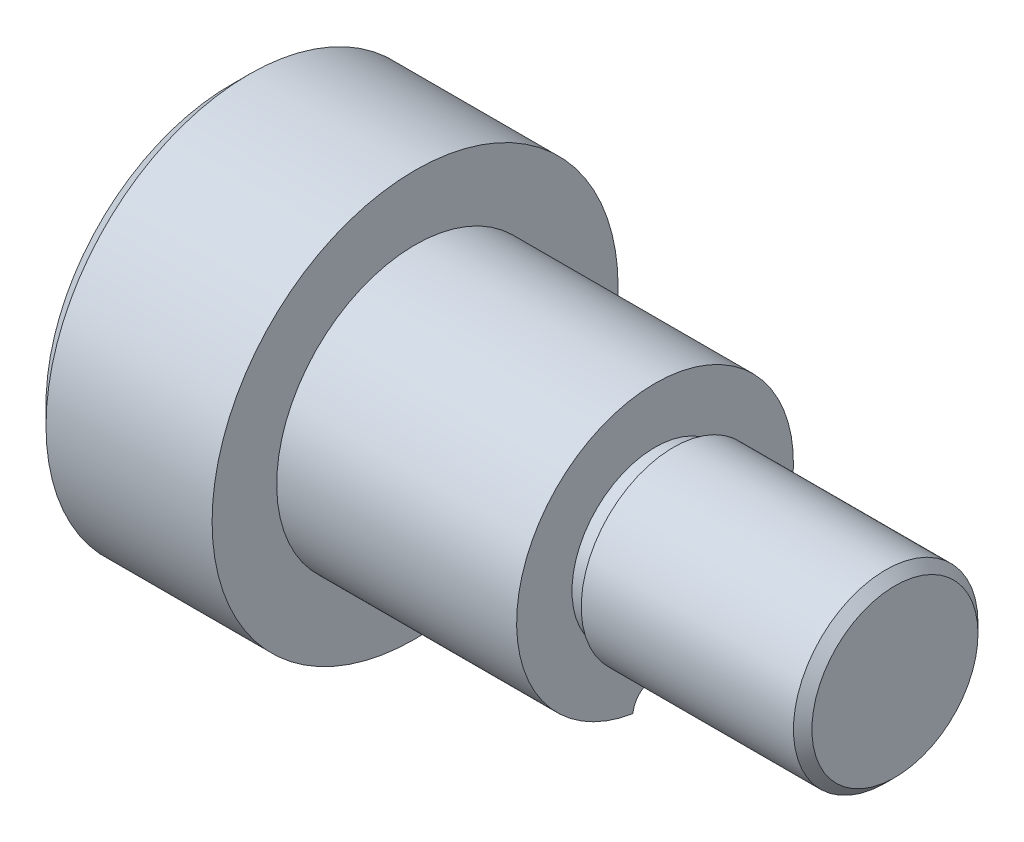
from build123d import *

# Parameters (mm, degrees)
ESQUISSE1_R          = 11
EXTRUSION1_DEPTH     = 10
ESQUISSE2_R          = 7.5
EXTRUSION2_DEPTH     = 13
ESQUISSE3_R          = 4.5
EXTRUSION3_DEPTH     = 1
ESQUISSE4_R          = 5
EXTRUSION4_DEPTH     = 12
CHANFREIN1_SIZE      = 0.5
CHANFREIN2_SIZE      = 1
D_GAGEMENT_M21_D     = 2.4
D_GAGEMENT_M21_DEPTH = 6
D_GAGEMENT_M21_TIP   = 0.721032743


with BuildPart() as part:
    # Esquisse1 → Extrusion1 (new body)
    with BuildSketch(Plane(origin=(0, 0, 0), x_dir=(0, 0, -1), z_dir=(1, 0, 0))):
        Circle(ESQUISSE1_R)
    extrude(amount=EXTRUSION1_DEPTH)

    # Esquisse2 → Extrusion2 (add)
    with BuildSketch(Plane(origin=(10, 0, 0), x_dir=(0, 0, -1), z_dir=(1, 0, 0))):
        with Locations(Location((0, 0, 0), (0, 0, 180))):
            Circle(ESQUISSE2_R)
    extrude(amount=EXTRUSION2_DEPTH)

    # Esquisse3 → Extrusion3 (add)
    with BuildSketch(Plane(origin=(23, 0, 0), x_dir=(0, 0, -1), z_dir=(1, 0, 0))):
        Circle(ESQUISSE3_R)
    extrude(amount=EXTRUSION3_DEPTH)

    # Esquisse4 → Extrusion4 (add)
    with BuildSketch(Plane(origin=(24, 0, 0), x_dir=(0, 0, -1), z_dir=(1, 0, 0))):
        Circle(ESQUISSE4_R)
    extrude(amount=EXTRUSION4_DEPTH)

    # Chanfrein1
    chanfrein1_edges = [part.edges().sort_by_distance(p)[0] for p in [
        (36, 0, 5),
    ]]
    chamfer(chanfrein1_edges, length=CHANFREIN1_SIZE)

    # Chanfrein2
    chanfrein2_edges = [part.edges().sort_by_distance(p)[0] for p in [
        (0, 0, 11),
    ]]
    chamfer(chanfrein2_edges, length=CHANFREIN2_SIZE)

    # D_gagement M21
    with Locations(Plane(origin=(23, 0, 0), x_dir=(0, 0, -1), z_dir=(1, 0, 0))):
        with Locations((0, -7.5)):
            Hole(D_GAGEMENT_M21_D / 2, depth=D_GAGEMENT_M21_DEPTH)
            with Locations((0, 0, -(D_GAGEMENT_M21_DEPTH + D_GAGEMENT_M21_TIP / 2))):  # 118° drill point
                Cone(0, D_GAGEMENT_M21_D / 2, D_GAGEMENT_M21_TIP, mode=Mode.SUBTRACT)


solid = part.part
